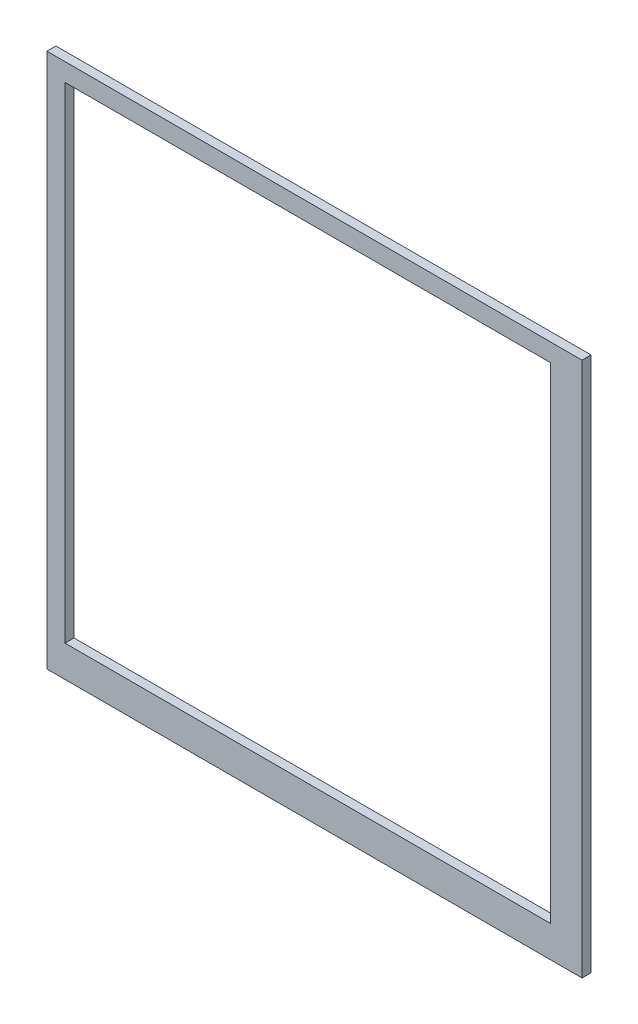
from build123d import *

# Parameters (mm, degrees)
SKETCH1_W           = 580
SKETCH1_H           = 580
SKETCH1_W_2         = 540
SKETCH1_H_2         = 540
BOSS_EXTRUDE1_DEPTH = 10
BOSS_EXTRUDE2_DEPTH = 10


with BuildPart() as part:
    # Sketch1 → Boss-Extrude1 (new body)
    with BuildSketch(Plane.XY):
        Rectangle(SKETCH1_W, SKETCH1_H)
        Rectangle(SKETCH1_W_2, SKETCH1_H_2, mode=Mode.SUBTRACT)
    extrude(amount=BOSS_EXTRUDE1_DEPTH)

    # Sketch2 → Boss-Extrude2 (add)
    with BuildSketch(Plane(origin=(0, 0, 0), x_dir=(-1, 0, 0), z_dir=(0, 0, -1))):
        Polygon((290, -305), (-305, -305), (-305, 290), (-290, 290), (-290, -290), (290, -290), align=None)
    extrude(amount=-BOSS_EXTRUDE2_DEPTH)


solid = part.part
